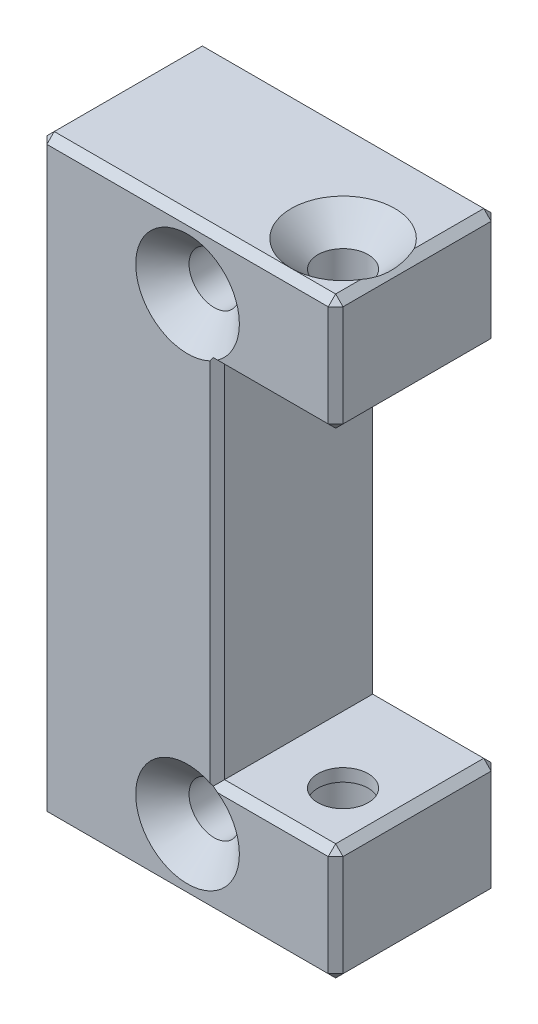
ISO-10303-21;
HEADER;
FILE_DESCRIPTION(('STEP AP214'),'2;1');
FILE_NAME('part.step','',(''),(''),'','','');
FILE_SCHEMA(('AUTOMOTIVE_DESIGN { 1 0 10303 214 1 1 1 1 }'));
ENDSEC;
DATA;
#1=APPLICATION_CONTEXT('core data for automotive mechanical design processes');
#2=APPLICATION_PROTOCOL_DEFINITION('international standard','automotive_design',2000,#1);
#3=PRODUCT_CONTEXT('',#1,'mechanical');
#4=PRODUCT('Part','Part','',(#3));
#5=PRODUCT_RELATED_PRODUCT_CATEGORY('part','',(#4));
#6=PRODUCT_DEFINITION_FORMATION('','',#4);
#7=PRODUCT_DEFINITION_CONTEXT('part definition',#1,'design');
#8=PRODUCT_DEFINITION('design','',#6,#7);
#9=PRODUCT_DEFINITION_SHAPE('','',#8);
#10=(LENGTH_UNIT() NAMED_UNIT(*) SI_UNIT(.MILLI.,.METRE.));
#11=(NAMED_UNIT(*) PLANE_ANGLE_UNIT() SI_UNIT($,.RADIAN.));
#12=(NAMED_UNIT(*) SI_UNIT($,.STERADIAN.) SOLID_ANGLE_UNIT());
#13=UNCERTAINTY_MEASURE_WITH_UNIT(LENGTH_MEASURE(1.E-05),#10,'distance_accuracy_value','');
#14=(GEOMETRIC_REPRESENTATION_CONTEXT(3) GLOBAL_UNCERTAINTY_ASSIGNED_CONTEXT((#13)) GLOBAL_UNIT_ASSIGNED_CONTEXT((#10,
#11,#12)) REPRESENTATION_CONTEXT('',''));
#15=CARTESIAN_POINT('',(0.,0.,0.));
#16=DIRECTION('',(0.,0.,1.));
#17=DIRECTION('',(1.,0.,0.));
#18=AXIS2_PLACEMENT_3D('',#15,#16,#17);
#19=CARTESIAN_POINT('',(6.5,20.,7.));
#20=DIRECTION('',(0.,1.,0.));
#21=DIRECTION('',(0.,0.,1.));
#22=AXIS2_PLACEMENT_3D('',#19,#20,#21);
#23=CYLINDRICAL_SURFACE('',#22,1.69999999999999);
#24=CARTESIAN_POINT('',(6.5,-12.15,7.));
#25=DIRECTION('',(0.,-1.,0.));
#26=DIRECTION('',(1.,0.,0.));
#27=AXIS2_PLACEMENT_3D('',#24,#25,#26);
#28=CIRCLE('',#27,1.69999999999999);
#29=CARTESIAN_POINT('',(8.2,-12.15,7.));
#30=VERTEX_POINT('',#29);
#31=EDGE_CURVE('E612',#30,#30,#28,.T.);
#32=ORIENTED_EDGE('',*,*,#31,.F.);
#33=EDGE_LOOP('',(#32));
#34=FACE_BOUND('',#33,.T.);
#35=CARTESIAN_POINT('',(6.5,-13.,7.));
#36=DIRECTION('',(0.,-1.,0.));
#37=DIRECTION('',(0.,0.,-1.));
#38=AXIS2_PLACEMENT_3D('',#35,#36,#37);
#39=CIRCLE('',#38,1.69999999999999);
#40=CARTESIAN_POINT('',(6.5,-13.,5.30000000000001));
#41=VERTEX_POINT('',#40);
#42=EDGE_CURVE('E45',#41,#41,#39,.F.);
#43=ORIENTED_EDGE('',*,*,#42,.F.);
#44=EDGE_LOOP('',(#43));
#45=FACE_BOUND('',#44,.T.);
#46=ADVANCED_FACE('F40',(#34,#45),#23,.F.);
#47=CARTESIAN_POINT('',(-10.,20.,11.));
#48=DIRECTION('',(0.,-1.,0.));
#49=DIRECTION('',(0.,0.,-1.));
#50=AXIS2_PLACEMENT_3D('',#47,#48,#49);
#51=PLANE('',#50);
#52=CARTESIAN_POINT('',(6.5,20.,7.));
#53=DIRECTION('',(0.,1.,0.));
#54=DIRECTION('',(0.,0.,1.));
#55=AXIS2_PLACEMENT_3D('',#52,#53,#54);
#56=CIRCLE('',#55,3.5);
#57=CARTESIAN_POINT('',(9.49999999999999,20.,5.19722436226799));
#58=VERTEX_POINT('',#57);
#59=CARTESIAN_POINT('',(6.5,20.,10.5));
#60=VERTEX_POINT('',#59);
#61=EDGE_CURVE('E215',#58,#60,#56,.T.);
#62=ORIENTED_EDGE('',*,*,#61,.F.);
#63=DIRECTION('',(0.,0.,-1.));
#64=VECTOR('',#63,1.);
#65=CARTESIAN_POINT('',(9.49999999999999,20.,11.));
#66=LINE('',#65,#64);
#67=CARTESIAN_POINT('',(9.49999999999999,20.,0.500000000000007));
#68=VERTEX_POINT('',#67);
#69=EDGE_CURVE('E229',#58,#68,#66,.T.);
#70=ORIENTED_EDGE('',*,*,#69,.T.);
#71=DIRECTION('',(-1.,0.,0.));
#72=VECTOR('',#71,1.);
#73=CARTESIAN_POINT('',(-10.,20.,0.500000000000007));
#74=LINE('',#73,#72);
#75=CARTESIAN_POINT('',(-9.49999999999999,20.,0.500000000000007));
#76=VERTEX_POINT('',#75);
#77=EDGE_CURVE('E242',#68,#76,#74,.T.);
#78=ORIENTED_EDGE('',*,*,#77,.T.);
#79=DIRECTION('',(0.,0.,1.));
#80=VECTOR('',#79,1.);
#81=CARTESIAN_POINT('',(-9.49999999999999,20.,11.));
#82=LINE('',#81,#80);
#83=CARTESIAN_POINT('',(-9.49999999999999,20.,10.5));
#84=VERTEX_POINT('',#83);
#85=EDGE_CURVE('E249',#76,#84,#82,.T.);
#86=ORIENTED_EDGE('',*,*,#85,.T.);
#87=DIRECTION('',(1.,0.,0.));
#88=VECTOR('',#87,1.);
#89=CARTESIAN_POINT('',(-10.,20.,10.5));
#90=LINE('',#89,#88);
#91=EDGE_CURVE('E231',#84,#60,#90,.T.);
#92=ORIENTED_EDGE('',*,*,#91,.T.);
#93=EDGE_LOOP('',(#62,#70,#78,#86,#92));
#94=FACE_BOUND('',#93,.T.);
#95=ADVANCED_FACE('F228',(#94),#51,.F.);
#96=CARTESIAN_POINT('',(10.,-20.,11.));
#97=DIRECTION('',(-1.,0.,0.));
#98=DIRECTION('',(0.,0.,1.));
#99=AXIS2_PLACEMENT_3D('',#96,#97,#98);
#100=PLANE('',#99);
#101=DIRECTION('',(0.,-1.,0.));
#102=VECTOR('',#101,1.);
#103=CARTESIAN_POINT('',(10.,-20.,10.5));
#104=LINE('',#103,#102);
#105=CARTESIAN_POINT('',(10.,-12.65,10.5));
#106=VERTEX_POINT('',#105);
#107=CARTESIAN_POINT('',(10.,-19.5,10.5));
#108=VERTEX_POINT('',#107);
#109=EDGE_CURVE('E51',#106,#108,#104,.T.);
#110=ORIENTED_EDGE('',*,*,#109,.T.);
#111=DIRECTION('',(0.,0.,-1.));
#112=VECTOR('',#111,1.);
#113=CARTESIAN_POINT('',(10.,-19.5,11.));
#114=LINE('',#113,#112);
#115=CARTESIAN_POINT('',(10.,-19.5,0.500000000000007));
#116=VERTEX_POINT('',#115);
#117=EDGE_CURVE('E11',#108,#116,#114,.T.);
#118=ORIENTED_EDGE('',*,*,#117,.T.);
#119=DIRECTION('',(0.,1.,0.));
#120=VECTOR('',#119,1.);
#121=CARTESIAN_POINT('',(10.,-12.15,0.500000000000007));
#122=LINE('',#121,#120);
#123=CARTESIAN_POINT('',(10.,-12.65,0.500000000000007));
#124=VERTEX_POINT('',#123);
#125=EDGE_CURVE('E836',#116,#124,#122,.T.);
#126=ORIENTED_EDGE('',*,*,#125,.T.);
#127=DIRECTION('',(0.,0.,1.));
#128=VECTOR('',#127,1.);
#129=CARTESIAN_POINT('',(10.,-12.65,11.));
#130=LINE('',#129,#128);
#131=EDGE_CURVE('E62',#124,#106,#130,.T.);
#132=ORIENTED_EDGE('',*,*,#131,.T.);
#133=EDGE_LOOP('',(#110,#118,#126,#132));
#134=FACE_BOUND('',#133,.T.);
#135=ADVANCED_FACE('F422',(#134),#100,.F.);
#136=DIRECTION('',(0.,1.,0.));
#137=VECTOR('',#136,1.);
#138=CARTESIAN_POINT('',(10.,20.,0.500000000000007));
#139=LINE('',#138,#137);
#140=CARTESIAN_POINT('',(10.,12.65,0.500000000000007));
#141=VERTEX_POINT('',#140);
#142=CARTESIAN_POINT('',(10.,19.5,0.500000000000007));
#143=VERTEX_POINT('',#142);
#144=EDGE_CURVE('E224',#141,#143,#139,.T.);
#145=ORIENTED_EDGE('',*,*,#144,.T.);
#146=DIRECTION('',(0.,0.,1.));
#147=VECTOR('',#146,1.);
#148=CARTESIAN_POINT('',(10.,19.5,11.));
#149=LINE('',#148,#147);
#150=CARTESIAN_POINT('',(10.,19.5,10.5));
#151=VERTEX_POINT('',#150);
#152=EDGE_CURVE('E247',#143,#151,#149,.T.);
#153=ORIENTED_EDGE('',*,*,#152,.T.);
#154=DIRECTION('',(0.,-1.,0.));
#155=VECTOR('',#154,1.);
#156=CARTESIAN_POINT('',(10.,-20.,10.5));
#157=LINE('',#156,#155);
#158=CARTESIAN_POINT('',(10.,12.65,10.5));
#159=VERTEX_POINT('',#158);
#160=EDGE_CURVE('E241',#151,#159,#157,.T.);
#161=ORIENTED_EDGE('',*,*,#160,.T.);
#162=DIRECTION('',(0.,0.,-1.));
#163=VECTOR('',#162,1.);
#164=CARTESIAN_POINT('',(10.,12.65,11.));
#165=LINE('',#164,#163);
#166=EDGE_CURVE('E255',#159,#141,#165,.T.);
#167=ORIENTED_EDGE('',*,*,#166,.T.);
#168=EDGE_LOOP('',(#145,#153,#161,#167));
#169=FACE_BOUND('',#168,.T.);
#170=ADVANCED_FACE('F419',(#169),#100,.F.);
#171=CARTESIAN_POINT('',(9.49999999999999,20.,8.80277563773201));
#172=VERTEX_POINT('',#171);
#173=EDGE_CURVE('E218',#60,#172,#56,.T.);
#174=ORIENTED_EDGE('',*,*,#173,.F.);
#175=DIRECTION('',(1.,0.,0.));
#176=VECTOR('',#175,1.);
#177=CARTESIAN_POINT('',(-10.,20.,10.5));
#178=LINE('',#177,#176);
#179=CARTESIAN_POINT('',(9.49999999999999,20.,10.5));
#180=VERTEX_POINT('',#179);
#181=EDGE_CURVE('E651',#60,#180,#178,.T.);
#182=ORIENTED_EDGE('',*,*,#181,.T.);
#183=DIRECTION('',(0.,0.,-1.));
#184=VECTOR('',#183,1.);
#185=CARTESIAN_POINT('',(9.49999999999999,20.,11.));
#186=LINE('',#185,#184);
#187=EDGE_CURVE('E645',#180,#172,#186,.T.);
#188=ORIENTED_EDGE('',*,*,#187,.T.);
#189=EDGE_LOOP('',(#174,#182,#188));
#190=FACE_BOUND('',#189,.T.);
#191=ADVANCED_FACE('F415',(#190),#51,.F.);
#192=CARTESIAN_POINT('',(-10.,-20.,11.));
#193=DIRECTION('',(1.,0.,0.));
#194=DIRECTION('',(0.,0.,-1.));
#195=AXIS2_PLACEMENT_3D('',#192,#193,#194);
#196=PLANE('',#195);
#197=DIRECTION('',(0.,1.,0.));
#198=VECTOR('',#197,1.);
#199=CARTESIAN_POINT('',(-10.,-20.,10.5));
#200=LINE('',#199,#198);
#201=CARTESIAN_POINT('',(-10.,-19.5,10.5));
#202=VERTEX_POINT('',#201);
#203=CARTESIAN_POINT('',(-10.,19.5,10.5));
#204=VERTEX_POINT('',#203);
#205=EDGE_CURVE('E801',#202,#204,#200,.T.);
#206=ORIENTED_EDGE('',*,*,#205,.T.);
#207=DIRECTION('',(0.,0.,-1.));
#208=VECTOR('',#207,1.);
#209=CARTESIAN_POINT('',(-10.,19.5,11.));
#210=LINE('',#209,#208);
#211=CARTESIAN_POINT('',(-10.,19.5,0.500000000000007));
#212=VERTEX_POINT('',#211);
#213=EDGE_CURVE('E665',#204,#212,#210,.T.);
#214=ORIENTED_EDGE('',*,*,#213,.T.);
#215=DIRECTION('',(0.,-1.,0.));
#216=VECTOR('',#215,1.);
#217=CARTESIAN_POINT('',(-10.,-20.,0.500000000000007));
#218=LINE('',#217,#216);
#219=CARTESIAN_POINT('',(-10.,-19.5,0.500000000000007));
#220=VERTEX_POINT('',#219);
#221=EDGE_CURVE('E223',#212,#220,#218,.T.);
#222=ORIENTED_EDGE('',*,*,#221,.T.);
#223=DIRECTION('',(0.,0.,1.));
#224=VECTOR('',#223,1.);
#225=CARTESIAN_POINT('',(-10.,-19.5,11.));
#226=LINE('',#225,#224);
#227=EDGE_CURVE('E799',#220,#202,#226,.T.);
#228=ORIENTED_EDGE('',*,*,#227,.T.);
#229=EDGE_LOOP('',(#206,#214,#222,#228));
#230=FACE_BOUND('',#229,.T.);
#231=ADVANCED_FACE('F411',(#230),#196,.F.);
#232=CARTESIAN_POINT('',(-10.,-20.,11.));
#233=DIRECTION('',(0.,1.,0.));
#234=DIRECTION('',(0.,0.,1.));
#235=AXIS2_PLACEMENT_3D('',#232,#233,#234);
#236=PLANE('',#235);
#237=CARTESIAN_POINT('',(6.5,-20.,7.));
#238=DIRECTION('',(0.,-1.,0.));
#239=DIRECTION('',(0.,0.,-1.));
#240=AXIS2_PLACEMENT_3D('',#237,#238,#239);
#241=CIRCLE('',#240,2.);
#242=CARTESIAN_POINT('',(6.5,-20.,5.));
#243=VERTEX_POINT('',#242);
#244=EDGE_CURVE('E603',#243,#243,#241,.T.);
#245=ORIENTED_EDGE('',*,*,#244,.F.);
#246=EDGE_LOOP('',(#245));
#247=FACE_BOUND('',#246,.T.);
#248=DIRECTION('',(0.,0.,1.));
#249=VECTOR('',#248,1.);
#250=CARTESIAN_POINT('',(9.49999999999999,-20.,11.));
#251=LINE('',#250,#249);
#252=CARTESIAN_POINT('',(9.49999999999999,-20.,0.500000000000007));
#253=VERTEX_POINT('',#252);
#254=CARTESIAN_POINT('',(9.49999999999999,-20.,10.5));
#255=VERTEX_POINT('',#254);
#256=EDGE_CURVE('E774',#253,#255,#251,.T.);
#257=ORIENTED_EDGE('',*,*,#256,.T.);
#258=DIRECTION('',(-1.,0.,0.));
#259=VECTOR('',#258,1.);
#260=CARTESIAN_POINT('',(-10.,-20.,10.5));
#261=LINE('',#260,#259);
#262=CARTESIAN_POINT('',(-9.49999999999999,-20.,10.5));
#263=VERTEX_POINT('',#262);
#264=EDGE_CURVE('E781',#255,#263,#261,.T.);
#265=ORIENTED_EDGE('',*,*,#264,.T.);
#266=DIRECTION('',(0.,0.,-1.));
#267=VECTOR('',#266,1.);
#268=CARTESIAN_POINT('',(-9.49999999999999,-20.,11.));
#269=LINE('',#268,#267);
#270=CARTESIAN_POINT('',(-9.49999999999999,-20.,0.500000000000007));
#271=VERTEX_POINT('',#270);
#272=EDGE_CURVE('E777',#263,#271,#269,.T.);
#273=ORIENTED_EDGE('',*,*,#272,.T.);
#274=DIRECTION('',(1.,0.,0.));
#275=VECTOR('',#274,1.);
#276=CARTESIAN_POINT('',(10.,-20.,0.500000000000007));
#277=LINE('',#276,#275);
#278=EDGE_CURVE('E771',#271,#253,#277,.T.);
#279=ORIENTED_EDGE('',*,*,#278,.T.);
#280=EDGE_LOOP('',(#257,#265,#273,#279));
#281=FACE_BOUND('',#280,.T.);
#282=ADVANCED_FACE('F404',(#247,#281),#236,.F.);
#283=CARTESIAN_POINT('',(0.,0.,11.));
#284=DIRECTION('',(0.,0.,-1.));
#285=DIRECTION('',(-1.,0.,0.));
#286=AXIS2_PLACEMENT_3D('',#283,#284,#285);
#287=PLANE('',#286);
#288=CARTESIAN_POINT('',(0.,-15.5,11.));
#289=DIRECTION('',(0.,0.,1.));
#290=DIRECTION('',(1.,0.,0.));
#291=AXIS2_PLACEMENT_3D('',#288,#289,#290);
#292=CIRCLE('',#291,3.5);
#293=CARTESIAN_POINT('',(1.5,-12.3377223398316,11.));
#294=VERTEX_POINT('',#293);
#295=CARTESIAN_POINT('',(2.03162496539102,-12.65,11.));
#296=VERTEX_POINT('',#295);
#297=EDGE_CURVE('E628',#294,#296,#292,.T.);
#298=ORIENTED_EDGE('',*,*,#297,.F.);
#299=DIRECTION('',(0.,1.,0.));
#300=VECTOR('',#299,1.);
#301=CARTESIAN_POINT('',(1.5,0.,11.));
#302=LINE('',#301,#300);
#303=CARTESIAN_POINT('',(1.5,12.3377223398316,11.));
#304=VERTEX_POINT('',#303);
#305=EDGE_CURVE('E768',#294,#304,#302,.T.);
#306=ORIENTED_EDGE('',*,*,#305,.T.);
#307=CARTESIAN_POINT('',(0.,15.5,11.));
#308=DIRECTION('',(0.,0.,1.));
#309=DIRECTION('',(1.,0.,0.));
#310=AXIS2_PLACEMENT_3D('',#307,#308,#309);
#311=CIRCLE('',#310,3.5);
#312=CARTESIAN_POINT('',(2.03162496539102,12.65,11.));
#313=VERTEX_POINT('',#312);
#314=EDGE_CURVE('E616',#313,#304,#311,.T.);
#315=ORIENTED_EDGE('',*,*,#314,.F.);
#316=DIRECTION('',(1.,0.,0.));
#317=VECTOR('',#316,1.);
#318=CARTESIAN_POINT('',(0.,12.65,11.));
#319=LINE('',#318,#317);
#320=CARTESIAN_POINT('',(9.49999999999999,12.65,11.));
#321=VERTEX_POINT('',#320);
#322=EDGE_CURVE('E746',#313,#321,#319,.T.);
#323=ORIENTED_EDGE('',*,*,#322,.T.);
#324=DIRECTION('',(0.,1.,0.));
#325=VECTOR('',#324,1.);
#326=CARTESIAN_POINT('',(9.49999999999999,0.,11.));
#327=LINE('',#326,#325);
#328=CARTESIAN_POINT('',(9.49999999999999,19.5,11.));
#329=VERTEX_POINT('',#328);
#330=EDGE_CURVE('E681',#321,#329,#327,.T.);
#331=ORIENTED_EDGE('',*,*,#330,.T.);
#332=DIRECTION('',(-1.,0.,0.));
#333=VECTOR('',#332,1.);
#334=CARTESIAN_POINT('',(0.,19.5,11.));
#335=LINE('',#334,#333);
#336=CARTESIAN_POINT('',(-9.49999999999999,19.5,11.));
#337=VERTEX_POINT('',#336);
#338=EDGE_CURVE('E749',#329,#337,#335,.T.);
#339=ORIENTED_EDGE('',*,*,#338,.T.);
#340=DIRECTION('',(0.,-1.,0.));
#341=VECTOR('',#340,1.);
#342=CARTESIAN_POINT('',(-9.49999999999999,0.,11.));
#343=LINE('',#342,#341);
#344=CARTESIAN_POINT('',(-9.49999999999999,-19.5,11.));
#345=VERTEX_POINT('',#344);
#346=EDGE_CURVE('E748',#337,#345,#343,.T.);
#347=ORIENTED_EDGE('',*,*,#346,.T.);
#348=DIRECTION('',(1.,0.,0.));
#349=VECTOR('',#348,1.);
#350=CARTESIAN_POINT('',(0.,-19.5,11.));
#351=LINE('',#350,#349);
#352=CARTESIAN_POINT('',(9.49999999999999,-19.5,11.));
#353=VERTEX_POINT('',#352);
#354=EDGE_CURVE('E755',#345,#353,#351,.T.);
#355=ORIENTED_EDGE('',*,*,#354,.T.);
#356=DIRECTION('',(0.,1.,0.));
#357=VECTOR('',#356,1.);
#358=CARTESIAN_POINT('',(9.49999999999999,0.,11.));
#359=LINE('',#358,#357);
#360=CARTESIAN_POINT('',(9.49999999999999,-12.65,11.));
#361=VERTEX_POINT('',#360);
#362=EDGE_CURVE('E762',#353,#361,#359,.T.);
#363=ORIENTED_EDGE('',*,*,#362,.T.);
#364=DIRECTION('',(-1.,0.,0.));
#365=VECTOR('',#364,1.);
#366=CARTESIAN_POINT('',(0.,-12.65,11.));
#367=LINE('',#366,#365);
#368=EDGE_CURVE('E765',#361,#296,#367,.T.);
#369=ORIENTED_EDGE('',*,*,#368,.T.);
#370=EDGE_LOOP('',(#298,#306,#315,#323,#331,#339,#347,#355,#363,#369));
#371=FACE_BOUND('',#370,.T.);
#372=ADVANCED_FACE('F401',(#371),#287,.F.);
#373=CARTESIAN_POINT('',(0.,0.,0.));
#374=DIRECTION('',(0.,0.,-1.));
#375=DIRECTION('',(-1.,0.,0.));
#376=AXIS2_PLACEMENT_3D('',#373,#374,#375);
#377=PLANE('',#376);
#378=DIRECTION('',(-1.,0.,0.));
#379=VECTOR('',#378,1.);
#380=CARTESIAN_POINT('',(-10.,-19.5,0.));
#381=LINE('',#380,#379);
#382=CARTESIAN_POINT('',(9.49999999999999,-19.5,0.));
#383=VERTEX_POINT('',#382);
#384=CARTESIAN_POINT('',(-9.49999999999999,-19.5,0.));
#385=VERTEX_POINT('',#384);
#386=EDGE_CURVE('E716',#383,#385,#381,.T.);
#387=ORIENTED_EDGE('',*,*,#386,.T.);
#388=DIRECTION('',(0.,1.,0.));
#389=VECTOR('',#388,1.);
#390=CARTESIAN_POINT('',(-9.49999999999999,20.,0.));
#391=LINE('',#390,#389);
#392=CARTESIAN_POINT('',(-9.49999999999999,19.5,0.));
#393=VERTEX_POINT('',#392);
#394=EDGE_CURVE('E719',#385,#393,#391,.T.);
#395=ORIENTED_EDGE('',*,*,#394,.T.);
#396=DIRECTION('',(1.,0.,0.));
#397=VECTOR('',#396,1.);
#398=CARTESIAN_POINT('',(10.,19.5,0.));
#399=LINE('',#398,#397);
#400=CARTESIAN_POINT('',(9.49999999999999,19.5,0.));
#401=VERTEX_POINT('',#400);
#402=EDGE_CURVE('E701',#393,#401,#399,.T.);
#403=ORIENTED_EDGE('',*,*,#402,.T.);
#404=DIRECTION('',(0.,-1.,0.));
#405=VECTOR('',#404,1.);
#406=CARTESIAN_POINT('',(9.49999999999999,12.15,0.));
#407=LINE('',#406,#405);
#408=CARTESIAN_POINT('',(9.49999999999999,12.65,0.));
#409=VERTEX_POINT('',#408);
#410=EDGE_CURVE('E687',#401,#409,#407,.T.);
#411=ORIENTED_EDGE('',*,*,#410,.T.);
#412=DIRECTION('',(-1.,0.,0.));
#413=VECTOR('',#412,1.);
#414=CARTESIAN_POINT('',(2.00000000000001,12.65,0.));
#415=LINE('',#414,#413);
#416=CARTESIAN_POINT('',(1.5,12.65,0.));
#417=VERTEX_POINT('',#416);
#418=EDGE_CURVE('E696',#409,#417,#415,.T.);
#419=ORIENTED_EDGE('',*,*,#418,.T.);
#420=DIRECTION('',(0.,-1.,0.));
#421=VECTOR('',#420,1.);
#422=CARTESIAN_POINT('',(1.5,-12.15,0.));
#423=LINE('',#422,#421);
#424=CARTESIAN_POINT('',(1.5,-12.65,0.));
#425=VERTEX_POINT('',#424);
#426=EDGE_CURVE('E700',#417,#425,#423,.T.);
#427=ORIENTED_EDGE('',*,*,#426,.T.);
#428=DIRECTION('',(1.,0.,0.));
#429=VECTOR('',#428,1.);
#430=CARTESIAN_POINT('',(10.,-12.65,0.));
#431=LINE('',#430,#429);
#432=CARTESIAN_POINT('',(9.49999999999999,-12.65,0.));
#433=VERTEX_POINT('',#432);
#434=EDGE_CURVE('E706',#425,#433,#431,.T.);
#435=ORIENTED_EDGE('',*,*,#434,.T.);
#436=DIRECTION('',(0.,-1.,0.));
#437=VECTOR('',#436,1.);
#438=CARTESIAN_POINT('',(9.49999999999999,-20.,0.));
#439=LINE('',#438,#437);
#440=EDGE_CURVE('E713',#433,#383,#439,.T.);
#441=ORIENTED_EDGE('',*,*,#440,.T.);
#442=EDGE_LOOP('',(#387,#395,#403,#411,#419,#427,#435,#441));
#443=FACE_BOUND('',#442,.T.);
#444=CARTESIAN_POINT('',(0.,15.5,0.));
#445=DIRECTION('',(0.,0.,1.));
#446=DIRECTION('',(1.,0.,0.));
#447=AXIS2_PLACEMENT_3D('',#444,#445,#446);
#448=CIRCLE('',#447,1.7);
#449=CARTESIAN_POINT('',(1.7,15.5,0.));
#450=VERTEX_POINT('',#449);
#451=EDGE_CURVE('E624',#450,#450,#448,.T.);
#452=ORIENTED_EDGE('',*,*,#451,.T.);
#453=EDGE_LOOP('',(#452));
#454=FACE_BOUND('',#453,.T.);
#455=CARTESIAN_POINT('',(0.,-15.5,0.));
#456=DIRECTION('',(0.,0.,1.));
#457=DIRECTION('',(1.,0.,0.));
#458=AXIS2_PLACEMENT_3D('',#455,#456,#457);
#459=CIRCLE('',#458,1.7);
#460=CARTESIAN_POINT('',(1.7,-15.5,0.));
#461=VERTEX_POINT('',#460);
#462=EDGE_CURVE('E636',#461,#461,#459,.T.);
#463=ORIENTED_EDGE('',*,*,#462,.T.);
#464=EDGE_LOOP('',(#463));
#465=FACE_BOUND('',#464,.T.);
#466=ADVANCED_FACE('F393',(#443,#454,#465),#377,.T.);
#467=CARTESIAN_POINT('',(10.,-12.15,0.));
#468=DIRECTION('',(0.,-1.,0.));
#469=DIRECTION('',(1.,0.,0.));
#470=AXIS2_PLACEMENT_3D('',#467,#468,#469);
#471=PLANE('',#470);
#472=ORIENTED_EDGE('',*,*,#31,.T.);
#473=EDGE_LOOP('',(#472));
#474=FACE_BOUND('',#473,.T.);
#475=DIRECTION('',(0.,0.,1.));
#476=VECTOR('',#475,1.);
#477=CARTESIAN_POINT('',(2.00000000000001,-12.15,0.));
#478=LINE('',#477,#476);
#479=CARTESIAN_POINT('',(2.00000000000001,-12.15,0.500000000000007));
#480=VERTEX_POINT('',#479);
#481=CARTESIAN_POINT('',(2.00000000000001,-12.15,10.5));
#482=VERTEX_POINT('',#481);
#483=EDGE_CURVE('E641',#480,#482,#478,.T.);
#484=ORIENTED_EDGE('',*,*,#483,.T.);
#485=DIRECTION('',(1.,0.,0.));
#486=VECTOR('',#485,1.);
#487=CARTESIAN_POINT('',(10.,-12.15,10.5));
#488=LINE('',#487,#486);
#489=CARTESIAN_POINT('',(9.49999999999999,-12.15,10.5));
#490=VERTEX_POINT('',#489);
#491=EDGE_CURVE('E841',#482,#490,#488,.T.);
#492=ORIENTED_EDGE('',*,*,#491,.T.);
#493=DIRECTION('',(0.,0.,-1.));
#494=VECTOR('',#493,1.);
#495=CARTESIAN_POINT('',(9.49999999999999,-12.15,0.));
#496=LINE('',#495,#494);
#497=CARTESIAN_POINT('',(9.49999999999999,-12.15,0.500000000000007));
#498=VERTEX_POINT('',#497);
#499=EDGE_CURVE('E860',#490,#498,#496,.T.);
#500=ORIENTED_EDGE('',*,*,#499,.T.);
#501=DIRECTION('',(-1.,0.,0.));
#502=VECTOR('',#501,1.);
#503=CARTESIAN_POINT('',(2.00000000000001,-12.15,0.500000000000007));
#504=LINE('',#503,#502);
#505=EDGE_CURVE('E370',#498,#480,#504,.T.);
#506=ORIENTED_EDGE('',*,*,#505,.T.);
#507=EDGE_LOOP('',(#484,#492,#500,#506));
#508=FACE_BOUND('',#507,.T.);
#509=ADVANCED_FACE('F389',(#474,#508),#471,.F.);
#510=CARTESIAN_POINT('',(2.00000000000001,12.15,0.));
#511=DIRECTION('',(-1.,0.,0.));
#512=DIRECTION('',(0.,0.,1.));
#513=AXIS2_PLACEMENT_3D('',#510,#511,#512);
#514=PLANE('',#513);
#515=DIRECTION('',(0.,0.,1.));
#516=VECTOR('',#515,1.);
#517=CARTESIAN_POINT('',(2.00000000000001,12.15,0.));
#518=LINE('',#517,#516);
#519=CARTESIAN_POINT('',(2.00000000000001,12.15,0.500000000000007));
#520=VERTEX_POINT('',#519);
#521=CARTESIAN_POINT('',(2.00000000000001,12.15,10.5));
#522=VERTEX_POINT('',#521);
#523=EDGE_CURVE('E640',#520,#522,#518,.T.);
#524=ORIENTED_EDGE('',*,*,#523,.T.);
#525=DIRECTION('',(0.,-1.,0.));
#526=VECTOR('',#525,1.);
#527=CARTESIAN_POINT('',(2.00000000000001,12.15,10.5));
#528=LINE('',#527,#526);
#529=EDGE_CURVE('E743',#522,#482,#528,.T.);
#530=ORIENTED_EDGE('',*,*,#529,.T.);
#531=ORIENTED_EDGE('',*,*,#483,.F.);
#532=DIRECTION('',(0.,1.,0.));
#533=VECTOR('',#532,1.);
#534=CARTESIAN_POINT('',(2.00000000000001,12.15,0.500000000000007));
#535=LINE('',#534,#533);
#536=EDGE_CURVE('E308',#480,#520,#535,.T.);
#537=ORIENTED_EDGE('',*,*,#536,.T.);
#538=EDGE_LOOP('',(#524,#530,#531,#537));
#539=FACE_BOUND('',#538,.T.);
#540=ADVANCED_FACE('F392',(#539),#514,.F.);
#541=CARTESIAN_POINT('',(10.,12.15,0.));
#542=DIRECTION('',(0.,1.,0.));
#543=DIRECTION('',(-1.,0.,0.));
#544=AXIS2_PLACEMENT_3D('',#541,#542,#543);
#545=PLANE('',#544);
#546=CARTESIAN_POINT('',(6.5,12.15,7.));
#547=DIRECTION('',(0.,1.,0.));
#548=DIRECTION('',(-1.,0.,0.));
#549=AXIS2_PLACEMENT_3D('',#546,#547,#548);
#550=CIRCLE('',#549,1.69999999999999);
#551=CARTESIAN_POINT('',(4.80000000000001,12.15,7.));
#552=VERTEX_POINT('',#551);
#553=EDGE_CURVE('E608',#552,#552,#550,.T.);
#554=ORIENTED_EDGE('',*,*,#553,.T.);
#555=EDGE_LOOP('',(#554));
#556=FACE_BOUND('',#555,.T.);
#557=DIRECTION('',(0.,0.,1.));
#558=VECTOR('',#557,1.);
#559=CARTESIAN_POINT('',(9.49999999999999,12.15,0.));
#560=LINE('',#559,#558);
#561=CARTESIAN_POINT('',(9.49999999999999,12.15,0.500000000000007));
#562=VERTEX_POINT('',#561);
#563=CARTESIAN_POINT('',(9.49999999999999,12.15,10.5));
#564=VERTEX_POINT('',#563);
#565=EDGE_CURVE('E723',#562,#564,#560,.T.);
#566=ORIENTED_EDGE('',*,*,#565,.T.);
#567=DIRECTION('',(-1.,0.,0.));
#568=VECTOR('',#567,1.);
#569=CARTESIAN_POINT('',(10.,12.15,10.5));
#570=LINE('',#569,#568);
#571=EDGE_CURVE('E727',#564,#522,#570,.T.);
#572=ORIENTED_EDGE('',*,*,#571,.T.);
#573=ORIENTED_EDGE('',*,*,#523,.F.);
#574=DIRECTION('',(1.,0.,0.));
#575=VECTOR('',#574,1.);
#576=CARTESIAN_POINT('',(10.,12.15,0.500000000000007));
#577=LINE('',#576,#575);
#578=EDGE_CURVE('E695',#520,#562,#577,.T.);
#579=ORIENTED_EDGE('',*,*,#578,.T.);
#580=EDGE_LOOP('',(#566,#572,#573,#579));
#581=FACE_BOUND('',#580,.T.);
#582=ADVANCED_FACE('F387',(#556,#581),#545,.F.);
#583=CARTESIAN_POINT('',(0.,-15.5,11.));
#584=DIRECTION('',(0.,0.,1.));
#585=DIRECTION('',(1.,0.,0.));
#586=AXIS2_PLACEMENT_3D('',#583,#584,#585);
#587=CYLINDRICAL_SURFACE('',#586,1.69999999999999);
#588=ORIENTED_EDGE('',*,*,#462,.F.);
#589=EDGE_LOOP('',(#588));
#590=FACE_BOUND('',#589,.T.);
#591=CARTESIAN_POINT('',(0.,-15.5,9.19999999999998));
#592=DIRECTION('',(0.,0.,1.));
#593=DIRECTION('',(1.,0.,0.));
#594=AXIS2_PLACEMENT_3D('',#591,#592,#593);
#595=CIRCLE('',#594,1.69999999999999);
#596=CARTESIAN_POINT('',(1.69999999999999,-15.5,9.19999999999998));
#597=VERTEX_POINT('',#596);
#598=EDGE_CURVE('E632',#597,#597,#595,.T.);
#599=ORIENTED_EDGE('',*,*,#598,.T.);
#600=EDGE_LOOP('',(#599));
#601=FACE_BOUND('',#600,.T.);
#602=ADVANCED_FACE('F382',(#590,#601),#587,.F.);
#603=CARTESIAN_POINT('',(0.,-15.5,11.));
#604=DIRECTION('',(0.,0.,1.));
#605=DIRECTION('',(1.,0.,0.));
#606=AXIS2_PLACEMENT_3D('',#603,#604,#605);
#607=CONICAL_SURFACE('',#606,3.5,0.785398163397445);
#608=ORIENTED_EDGE('',*,*,#598,.F.);
#609=EDGE_LOOP('',(#608));
#610=FACE_BOUND('',#609,.T.);
#611=CARTESIAN_POINT('',(2.03162496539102,-12.65,11.));
#612=CARTESIAN_POINT('',(1.99776756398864,-12.6391675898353,10.9891675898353));
#613=CARTESIAN_POINT('',(1.96376597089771,-12.6285599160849,10.9785599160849));
#614=CARTESIAN_POINT('',(1.89549359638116,-12.6078134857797,10.9578134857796));
#615=CARTESIAN_POINT('',(1.86122292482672,-12.5976745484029,10.9476745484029));
#616=CARTESIAN_POINT('',(1.79240461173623,-12.5778764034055,10.9278764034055));
#617=CARTESIAN_POINT('',(1.75785696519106,-12.5682172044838,10.9182172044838));
#618=CARTESIAN_POINT('',(1.68847941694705,-12.5493904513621,10.8993904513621));
#619=CARTESIAN_POINT('',(1.65364941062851,-12.5402230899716,10.8902230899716));
#620=CARTESIAN_POINT('',(1.61868872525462,-12.5313112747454,10.8813112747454));
#621=B_SPLINE_CURVE_WITH_KNOTS('',3,(#611,#612,#613,#614,#615,#616,#617,#618,#619,#620),
.UNSPECIFIED.,.F.,.F.,(4,2,2,2,4),(0.,0.11148453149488,0.222925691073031,0.33436887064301,
0.445855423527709),.UNSPECIFIED.);
#622=CARTESIAN_POINT('',(1.61868872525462,-12.5313112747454,10.8813112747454));
#623=VERTEX_POINT('',#622);
#624=EDGE_CURVE('E371',#296,#623,#621,.T.);
#625=ORIENTED_EDGE('',*,*,#624,.T.);
#626=CARTESIAN_POINT('',(1.61868872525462,-12.5313112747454,10.8813112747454));
#627=CARTESIAN_POINT('',(1.59926379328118,-12.4986092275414,10.9007362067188));
#628=CARTESIAN_POINT('',(1.57966058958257,-12.466125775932,10.9203394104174));
#629=CARTESIAN_POINT('',(1.54009768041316,-12.4015961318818,10.9599023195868));
#630=CARTESIAN_POINT('',(1.52013797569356,-12.36954993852,10.9798620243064));
#631=CARTESIAN_POINT('',(1.5,-12.3377223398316,11.));
#632=B_SPLINE_CURVE_WITH_KNOTS('',3,(#626,#627,#628,#629,#630,#631),.UNSPECIFIED.,.F.,.F.,(4,2,
4),(0.,0.128116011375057,0.256231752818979),.UNSPECIFIED.);
#633=EDGE_CURVE('E362',#623,#294,#632,.T.);
#634=ORIENTED_EDGE('',*,*,#633,.T.);
#635=ORIENTED_EDGE('',*,*,#297,.T.);
#636=EDGE_LOOP('',(#625,#634,#635));
#637=FACE_BOUND('',#636,.T.);
#638=ADVANCED_FACE('F378',(#610,#637),#607,.F.);
#639=CARTESIAN_POINT('',(0.,15.5,11.));
#640=DIRECTION('',(0.,0.,1.));
#641=DIRECTION('',(1.,0.,0.));
#642=AXIS2_PLACEMENT_3D('',#639,#640,#641);
#643=CYLINDRICAL_SURFACE('',#642,1.69999999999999);
#644=ORIENTED_EDGE('',*,*,#451,.F.);
#645=EDGE_LOOP('',(#644));
#646=FACE_BOUND('',#645,.T.);
#647=CARTESIAN_POINT('',(0.,15.5,9.19999999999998));
#648=DIRECTION('',(0.,0.,1.));
#649=DIRECTION('',(1.,0.,0.));
#650=AXIS2_PLACEMENT_3D('',#647,#648,#649);
#651=CIRCLE('',#650,1.69999999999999);
#652=CARTESIAN_POINT('',(1.69999999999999,15.5,9.19999999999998));
#653=VERTEX_POINT('',#652);
#654=EDGE_CURVE('E620',#653,#653,#651,.T.);
#655=ORIENTED_EDGE('',*,*,#654,.T.);
#656=EDGE_LOOP('',(#655));
#657=FACE_BOUND('',#656,.T.);
#658=ADVANCED_FACE('F287',(#646,#657),#643,.F.);
#659=CARTESIAN_POINT('',(0.,15.5,11.));
#660=DIRECTION('',(0.,0.,1.));
#661=DIRECTION('',(1.,0.,0.));
#662=AXIS2_PLACEMENT_3D('',#659,#660,#661);
#663=CONICAL_SURFACE('',#662,3.5,0.785398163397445);
#664=ORIENTED_EDGE('',*,*,#654,.F.);
#665=EDGE_LOOP('',(#664));
#666=FACE_BOUND('',#665,.T.);
#667=CARTESIAN_POINT('',(1.5,12.3377223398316,11.));
#668=CARTESIAN_POINT('',(1.52013797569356,12.36954993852,10.9798620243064));
#669=CARTESIAN_POINT('',(1.54009768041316,12.4015961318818,10.9599023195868));
#670=CARTESIAN_POINT('',(1.57966058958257,12.466125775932,10.9203394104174));
#671=CARTESIAN_POINT('',(1.59926379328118,12.4986092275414,10.9007362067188));
#672=CARTESIAN_POINT('',(1.61868872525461,12.5313112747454,10.8813112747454));
#673=B_SPLINE_CURVE_WITH_KNOTS('',3,(#667,#668,#669,#670,#671,#672),.UNSPECIFIED.,.F.,.F.,(4,2,
4),(0.,0.128115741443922,0.25623175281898),.UNSPECIFIED.);
#674=CARTESIAN_POINT('',(1.61868872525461,12.5313112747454,10.8813112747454));
#675=VERTEX_POINT('',#674);
#676=EDGE_CURVE('E292',#304,#675,#673,.T.);
#677=ORIENTED_EDGE('',*,*,#676,.T.);
#678=CARTESIAN_POINT('',(1.61868872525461,12.5313112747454,10.8813112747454));
#679=CARTESIAN_POINT('',(1.65364941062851,12.5402230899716,10.8902230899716));
#680=CARTESIAN_POINT('',(1.68847941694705,12.5493904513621,10.8993904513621));
#681=CARTESIAN_POINT('',(1.75785696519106,12.5682172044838,10.9182172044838));
#682=CARTESIAN_POINT('',(1.79240461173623,12.5778764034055,10.9278764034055));
#683=CARTESIAN_POINT('',(1.86122292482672,12.5976745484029,10.9476745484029));
#684=CARTESIAN_POINT('',(1.89549359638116,12.6078134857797,10.9578134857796));
#685=CARTESIAN_POINT('',(1.96376597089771,12.6285599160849,10.9785599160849));
#686=CARTESIAN_POINT('',(1.99776756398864,12.6391675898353,10.9891675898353));
#687=CARTESIAN_POINT('',(2.03162496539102,12.65,11.));
#688=B_SPLINE_CURVE_WITH_KNOTS('',3,(#678,#679,#680,#681,#682,#683,#684,#685,#686,#687),
.UNSPECIFIED.,.F.,.F.,(4,2,2,2,4),(0.,0.111486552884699,0.222929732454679,0.33437089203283,
0.445855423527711),.UNSPECIFIED.);
#689=EDGE_CURVE('E300',#675,#313,#688,.T.);
#690=ORIENTED_EDGE('',*,*,#689,.T.);
#691=ORIENTED_EDGE('',*,*,#314,.T.);
#692=EDGE_LOOP('',(#677,#690,#691));
#693=FACE_BOUND('',#692,.T.);
#694=ADVANCED_FACE('F283',(#666,#693),#663,.F.);
#695=CARTESIAN_POINT('',(6.5,18.2,7.));
#696=DIRECTION('',(0.,1.,0.));
#697=DIRECTION('',(0.,0.,1.));
#698=AXIS2_PLACEMENT_3D('',#695,#696,#697);
#699=CIRCLE('',#698,1.69999999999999);
#700=CARTESIAN_POINT('',(6.5,18.2,8.69999999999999));
#701=VERTEX_POINT('',#700);
#702=EDGE_CURVE('E233',#701,#701,#699,.T.);
#703=ORIENTED_EDGE('',*,*,#702,.T.);
#704=EDGE_LOOP('',(#703));
#705=FACE_BOUND('',#704,.T.);
#706=ORIENTED_EDGE('',*,*,#553,.F.);
#707=EDGE_LOOP('',(#706));
#708=FACE_BOUND('',#707,.T.);
#709=ADVANCED_FACE('F276',(#705,#708),#23,.F.);
#710=CARTESIAN_POINT('',(6.5,20.,7.));
#711=DIRECTION('',(0.,1.,0.));
#712=DIRECTION('',(0.,0.,1.));
#713=AXIS2_PLACEMENT_3D('',#710,#711,#712);
#714=CONICAL_SURFACE('',#713,3.5,0.785398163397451);
#715=ORIENTED_EDGE('',*,*,#702,.F.);
#716=EDGE_LOOP('',(#715));
#717=FACE_BOUND('',#716,.T.);
#718=CARTESIAN_POINT('',(9.49999999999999,20.,8.80277563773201));
#719=CARTESIAN_POINT('',(9.51990733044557,19.9800926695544,8.73099954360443));
#720=CARTESIAN_POINT('',(9.53878207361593,19.9612179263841,8.65865656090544));
#721=CARTESIAN_POINT('',(9.57434471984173,19.9256552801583,8.51288933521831));
#722=CARTESIAN_POINT('',(9.59103221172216,19.9089677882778,8.43946489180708));
#723=CARTESIAN_POINT('',(9.63764989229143,19.8623501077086,8.21754939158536));
#724=CARTESIAN_POINT('',(9.6640972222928,19.8359027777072,8.06755193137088));
#725=CARTESIAN_POINT('',(9.70669182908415,19.7933081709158,7.76533788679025));
#726=CARTESIAN_POINT('',(9.72288359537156,19.7771164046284,7.61313385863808));
#727=CARTESIAN_POINT('',(9.74453323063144,19.7554667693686,7.30728048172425));
#728=CARTESIAN_POINT('',(9.7499982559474,19.7500017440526,7.15363216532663));
#729=CARTESIAN_POINT('',(9.75000149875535,19.7499985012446,6.86797586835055));
#730=CARTESIAN_POINT('',(9.74596844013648,19.7540315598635,6.73596366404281));
#731=CARTESIAN_POINT('',(9.72995898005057,19.7700410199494,6.47290608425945));
#732=CARTESIAN_POINT('',(9.71798259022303,19.782017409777,6.3418607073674));
#733=CARTESIAN_POINT('',(9.68645101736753,19.8135489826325,6.08183785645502));
#734=CARTESIAN_POINT('',(9.66690777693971,19.8330922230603,5.95285745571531));
#735=CARTESIAN_POINT('',(9.62075444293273,19.8792455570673,5.69750804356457));
#736=CARTESIAN_POINT('',(9.59414732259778,19.9058526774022,5.57113795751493));
#737=CARTESIAN_POINT('',(9.55430477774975,19.9456952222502,5.40444450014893));
#738=CARTESIAN_POINT('',(9.54392596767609,19.9560740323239,5.36271873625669));
#739=CARTESIAN_POINT('',(9.52247727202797,19.977522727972,5.27967560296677));
#740=CARTESIAN_POINT('',(9.51140815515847,19.9885918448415,5.23835783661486));
#741=CARTESIAN_POINT('',(9.49999999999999,20.,5.19722436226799));
#742=B_SPLINE_CURVE_WITH_KNOTS('',3,(#718,#719,#720,#721,#722,#723,#724,#725,#726,#727,#728,
#729,#730,#731,#732,#733,#734,#735,#736,#737,#738,#739,#740,#741),.UNSPECIFIED.,.F.,.F.,(4,2,2,
2,2,2,2,2,2,2,2,4),(0.,0.231269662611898,0.462582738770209,0.925645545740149,1.38668553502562,
1.84741783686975,2.24334913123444,2.63927984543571,3.03458820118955,3.42973043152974,
3.56241822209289,3.69496080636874),.UNSPECIFIED.);
#743=EDGE_CURVE('E212',#172,#58,#742,.T.);
#744=ORIENTED_EDGE('',*,*,#743,.T.);
#745=ORIENTED_EDGE('',*,*,#61,.T.);
#746=ORIENTED_EDGE('',*,*,#173,.T.);
#747=EDGE_LOOP('',(#744,#745,#746));
#748=FACE_BOUND('',#747,.T.);
#749=ADVANCED_FACE('F214',(#717,#748),#714,.F.);
#750=CARTESIAN_POINT('',(9.49999999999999,0.,11.));
#751=DIRECTION('',(-0.707106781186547,0.,-0.707106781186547));
#752=DIRECTION('',(0.,1.,0.));
#753=AXIS2_PLACEMENT_3D('',#750,#751,#752);
#754=PLANE('',#753);
#755=DIRECTION('',(-0.707106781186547,0.,0.707106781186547));
#756=VECTOR('',#755,1.);
#757=CARTESIAN_POINT('',(9.75,-12.65,10.75));
#758=LINE('',#757,#756);
#759=EDGE_CURVE('E591',#361,#106,#758,.F.);
#760=ORIENTED_EDGE('',*,*,#759,.F.);
#761=ORIENTED_EDGE('',*,*,#362,.F.);
#762=DIRECTION('',(0.707106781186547,0.,-0.707106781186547));
#763=VECTOR('',#762,1.);
#764=CARTESIAN_POINT('',(9.75,-19.5,10.75));
#765=LINE('',#764,#763);
#766=EDGE_CURVE('E588',#108,#353,#765,.F.);
#767=ORIENTED_EDGE('',*,*,#766,.F.);
#768=ORIENTED_EDGE('',*,*,#109,.F.);
#769=EDGE_LOOP('',(#760,#761,#767,#768));
#770=FACE_BOUND('',#769,.T.);
#771=ADVANCED_FACE('F43',(#770),#754,.F.);
#772=CARTESIAN_POINT('',(9.49999999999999,-12.15,10.5));
#773=DIRECTION('',(0.577350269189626,0.577350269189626,0.577350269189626));
#774=DIRECTION('',(0.707106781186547,0.,-0.707106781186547));
#775=AXIS2_PLACEMENT_3D('',#772,#773,#774);
#776=PLANE('',#775);
#777=DIRECTION('',(0.,0.707106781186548,-0.707106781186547));
#778=VECTOR('',#777,1.);
#779=CARTESIAN_POINT('',(9.49999999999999,-12.15,10.5));
#780=LINE('',#779,#778);
#781=EDGE_CURVE('E576',#361,#490,#780,.T.);
#782=ORIENTED_EDGE('',*,*,#781,.F.);
#783=ORIENTED_EDGE('',*,*,#759,.T.);
#784=DIRECTION('',(0.707106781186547,-0.707106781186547,0.));
#785=VECTOR('',#784,1.);
#786=CARTESIAN_POINT('',(9.49999999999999,-12.15,10.5));
#787=LINE('',#786,#785);
#788=EDGE_CURVE('E580',#490,#106,#787,.T.);
#789=ORIENTED_EDGE('',*,*,#788,.F.);
#790=EDGE_LOOP('',(#782,#783,#789));
#791=FACE_BOUND('',#790,.T.);
#792=ADVANCED_FACE('F879',(#791),#776,.T.);
#793=CARTESIAN_POINT('',(9.49999999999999,-20.,10.5));
#794=DIRECTION('',(0.577350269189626,-0.577350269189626,0.577350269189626));
#795=DIRECTION('',(0.707106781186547,0.,-0.707106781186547));
#796=AXIS2_PLACEMENT_3D('',#793,#794,#795);
#797=PLANE('',#796);
#798=DIRECTION('',(0.,0.707106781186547,0.707106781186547));
#799=VECTOR('',#798,1.);
#800=CARTESIAN_POINT('',(9.49999999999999,-20.,10.5));
#801=LINE('',#800,#799);
#802=EDGE_CURVE('E572',#255,#353,#801,.T.);
#803=ORIENTED_EDGE('',*,*,#802,.F.);
#804=DIRECTION('',(-0.707106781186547,-0.707106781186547,0.));
#805=VECTOR('',#804,1.);
#806=CARTESIAN_POINT('',(9.49999999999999,-20.,10.5));
#807=LINE('',#806,#805);
#808=EDGE_CURVE('E584',#108,#255,#807,.T.);
#809=ORIENTED_EDGE('',*,*,#808,.F.);
#810=ORIENTED_EDGE('',*,*,#766,.T.);
#811=EDGE_LOOP('',(#803,#809,#810));
#812=FACE_BOUND('',#811,.T.);
#813=ADVANCED_FACE('F825',(#812),#797,.T.);
#814=CARTESIAN_POINT('',(10.,-19.5,11.));
#815=DIRECTION('',(-0.707106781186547,0.707106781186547,0.));
#816=DIRECTION('',(0.,0.,-1.));
#817=AXIS2_PLACEMENT_3D('',#814,#815,#816);
#818=PLANE('',#817);
#819=ORIENTED_EDGE('',*,*,#808,.T.);
#820=ORIENTED_EDGE('',*,*,#256,.F.);
#821=DIRECTION('',(0.707106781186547,0.707106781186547,0.));
#822=VECTOR('',#821,1.);
#823=CARTESIAN_POINT('',(10.,-19.5,0.500000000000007));
#824=LINE('',#823,#822);
#825=EDGE_CURVE('E568',#116,#253,#824,.F.);
#826=ORIENTED_EDGE('',*,*,#825,.F.);
#827=ORIENTED_EDGE('',*,*,#117,.F.);
#828=EDGE_LOOP('',(#819,#820,#826,#827));
#829=FACE_BOUND('',#828,.T.);
#830=ADVANCED_FACE('F834',(#829),#818,.F.);
#831=CARTESIAN_POINT('',(10.,-20.,0.500000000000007));
#832=DIRECTION('',(0.707106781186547,0.,-0.707106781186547));
#833=DIRECTION('',(0.,-1.,0.));
#834=AXIS2_PLACEMENT_3D('',#831,#832,#833);
#835=PLANE('',#834);
#836=DIRECTION('',(-0.707106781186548,0.,-0.707106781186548));
#837=VECTOR('',#836,1.);
#838=CARTESIAN_POINT('',(9.75,-12.65,0.250000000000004));
#839=LINE('',#838,#837);
#840=EDGE_CURVE('E561',#124,#433,#839,.T.);
#841=ORIENTED_EDGE('',*,*,#840,.F.);
#842=ORIENTED_EDGE('',*,*,#125,.F.);
#843=DIRECTION('',(0.707106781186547,0.,0.707106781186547));
#844=VECTOR('',#843,1.);
#845=CARTESIAN_POINT('',(10.,-19.5,0.500000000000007));
#846=LINE('',#845,#844);
#847=EDGE_CURVE('E565',#383,#116,#846,.T.);
#848=ORIENTED_EDGE('',*,*,#847,.F.);
#849=ORIENTED_EDGE('',*,*,#440,.F.);
#850=EDGE_LOOP('',(#841,#842,#848,#849));
#851=FACE_BOUND('',#850,.T.);
#852=ADVANCED_FACE('F851',(#851),#835,.T.);
#853=CARTESIAN_POINT('',(10.,-12.65,11.));
#854=DIRECTION('',(-0.707106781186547,-0.707106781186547,0.));
#855=DIRECTION('',(0.,0.,1.));
#856=AXIS2_PLACEMENT_3D('',#853,#854,#855);
#857=PLANE('',#856);
#858=ORIENTED_EDGE('',*,*,#788,.T.);
#859=ORIENTED_EDGE('',*,*,#131,.F.);
#860=DIRECTION('',(-0.707106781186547,0.707106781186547,0.));
#861=VECTOR('',#860,1.);
#862=CARTESIAN_POINT('',(9.49999999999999,-12.15,0.500000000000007));
#863=LINE('',#862,#861);
#864=EDGE_CURVE('E557',#498,#124,#863,.F.);
#865=ORIENTED_EDGE('',*,*,#864,.F.);
#866=ORIENTED_EDGE('',*,*,#499,.F.);
#867=EDGE_LOOP('',(#858,#859,#865,#866));
#868=FACE_BOUND('',#867,.T.);
#869=ADVANCED_FACE('F845',(#868),#857,.F.);
#870=CARTESIAN_POINT('',(10.,-12.15,10.5));
#871=DIRECTION('',(0.,-0.707106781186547,-0.707106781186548));
#872=DIRECTION('',(1.,0.,0.));
#873=AXIS2_PLACEMENT_3D('',#870,#871,#872);
#874=PLANE('',#873);
#875=ORIENTED_EDGE('',*,*,#781,.T.);
#876=ORIENTED_EDGE('',*,*,#491,.F.);
#877=DIRECTION('',(0.577350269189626,0.577350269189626,-0.577350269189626));
#878=VECTOR('',#877,1.);
#879=CARTESIAN_POINT('',(4.66666666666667,-9.48333333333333,7.83333333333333));
#880=LINE('',#879,#878);
#881=EDGE_CURVE('E553',#623,#482,#880,.T.);
#882=ORIENTED_EDGE('',*,*,#881,.F.);
#883=ORIENTED_EDGE('',*,*,#624,.F.);
#884=ORIENTED_EDGE('',*,*,#368,.F.);
#885=EDGE_LOOP('',(#875,#876,#882,#883,#884));
#886=FACE_BOUND('',#885,.T.);
#887=ADVANCED_FACE('F877',(#886),#874,.F.);
#888=CARTESIAN_POINT('',(0.,-19.5,11.));
#889=DIRECTION('',(0.,0.707106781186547,-0.707106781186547));
#890=DIRECTION('',(1.,0.,0.));
#891=AXIS2_PLACEMENT_3D('',#888,#889,#890);
#892=PLANE('',#891);
#893=ORIENTED_EDGE('',*,*,#802,.T.);
#894=ORIENTED_EDGE('',*,*,#354,.F.);
#895=DIRECTION('',(0.,-0.707106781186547,-0.707106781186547));
#896=VECTOR('',#895,1.);
#897=CARTESIAN_POINT('',(-9.49999999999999,-19.5,11.));
#898=LINE('',#897,#896);
#899=EDGE_CURVE('E549',#263,#345,#898,.F.);
#900=ORIENTED_EDGE('',*,*,#899,.F.);
#901=ORIENTED_EDGE('',*,*,#264,.F.);
#902=EDGE_LOOP('',(#893,#894,#900,#901));
#903=FACE_BOUND('',#902,.T.);
#904=ADVANCED_FACE('F828',(#903),#892,.F.);
#905=CARTESIAN_POINT('',(10.,-19.5,0.500000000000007));
#906=DIRECTION('',(0.577350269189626,-0.577350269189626,-0.577350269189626));
#907=DIRECTION('',(-0.707106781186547,0.,-0.707106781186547));
#908=AXIS2_PLACEMENT_3D('',#905,#906,#907);
#909=PLANE('',#908);
#910=ORIENTED_EDGE('',*,*,#847,.T.);
#911=ORIENTED_EDGE('',*,*,#825,.T.);
#912=DIRECTION('',(0.,0.707106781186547,-0.707106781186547));
#913=VECTOR('',#912,1.);
#914=CARTESIAN_POINT('',(9.49999999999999,-19.75,0.250000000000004));
#915=LINE('',#914,#913);
#916=EDGE_CURVE('E541',#383,#253,#915,.F.);
#917=ORIENTED_EDGE('',*,*,#916,.F.);
#918=EDGE_LOOP('',(#910,#911,#917));
#919=FACE_BOUND('',#918,.T.);
#920=ADVANCED_FACE('F918',(#919),#909,.T.);
#921=CARTESIAN_POINT('',(9.49999999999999,-12.15,0.500000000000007));
#922=DIRECTION('',(0.577350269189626,0.577350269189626,-0.577350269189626));
#923=DIRECTION('',(0.,0.707106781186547,0.707106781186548));
#924=AXIS2_PLACEMENT_3D('',#921,#922,#923);
#925=PLANE('',#924);
#926=ORIENTED_EDGE('',*,*,#864,.T.);
#927=ORIENTED_EDGE('',*,*,#840,.T.);
#928=DIRECTION('',(0.,0.707106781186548,0.707106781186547));
#929=VECTOR('',#928,1.);
#930=CARTESIAN_POINT('',(9.49999999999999,-12.15,0.500000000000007));
#931=LINE('',#930,#929);
#932=EDGE_CURVE('E537',#498,#433,#931,.F.);
#933=ORIENTED_EDGE('',*,*,#932,.F.);
#934=EDGE_LOOP('',(#926,#927,#933));
#935=FACE_BOUND('',#934,.T.);
#936=ADVANCED_FACE('F357',(#935),#925,.T.);
#937=CARTESIAN_POINT('',(2.00000000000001,12.15,10.5));
#938=DIRECTION('',(-0.707106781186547,0.,-0.707106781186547));
#939=DIRECTION('',(0.,-1.,0.));
#940=AXIS2_PLACEMENT_3D('',#937,#938,#939);
#941=PLANE('',#940);
#942=ORIENTED_EDGE('',*,*,#881,.T.);
#943=ORIENTED_EDGE('',*,*,#529,.F.);
#944=DIRECTION('',(0.577350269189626,-0.577350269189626,-0.577350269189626));
#945=VECTOR('',#944,1.);
#946=CARTESIAN_POINT('',(2.00000000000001,12.15,10.5));
#947=LINE('',#946,#945);
#948=EDGE_CURVE('E534',#675,#522,#947,.T.);
#949=ORIENTED_EDGE('',*,*,#948,.F.);
#950=ORIENTED_EDGE('',*,*,#676,.F.);
#951=ORIENTED_EDGE('',*,*,#305,.F.);
#952=ORIENTED_EDGE('',*,*,#633,.F.);
#953=EDGE_LOOP('',(#942,#943,#949,#950,#951,#952));
#954=FACE_BOUND('',#953,.T.);
#955=ADVANCED_FACE('F349',(#954),#941,.F.);
#956=CARTESIAN_POINT('',(-9.49999999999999,-19.5,11.));
#957=DIRECTION('',(-0.577350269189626,-0.577350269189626,0.577350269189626));
#958=DIRECTION('',(0.707106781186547,0.,0.707106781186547));
#959=AXIS2_PLACEMENT_3D('',#956,#957,#958);
#960=PLANE('',#959);
#961=DIRECTION('',(0.707106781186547,0.,0.707106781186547));
#962=VECTOR('',#961,1.);
#963=CARTESIAN_POINT('',(-9.49999999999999,-19.5,11.));
#964=LINE('',#963,#962);
#965=EDGE_CURVE('E531',#202,#345,#964,.T.);
#966=ORIENTED_EDGE('',*,*,#965,.F.);
#967=DIRECTION('',(-0.707106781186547,0.707106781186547,0.));
#968=VECTOR('',#967,1.);
#969=CARTESIAN_POINT('',(-9.74999999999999,-19.75,10.5));
#970=LINE('',#969,#968);
#971=EDGE_CURVE('E545',#263,#202,#970,.T.);
#972=ORIENTED_EDGE('',*,*,#971,.F.);
#973=ORIENTED_EDGE('',*,*,#899,.T.);
#974=EDGE_LOOP('',(#966,#972,#973));
#975=FACE_BOUND('',#974,.T.);
#976=ADVANCED_FACE('F343',(#975),#960,.T.);
#977=CARTESIAN_POINT('',(-9.49999999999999,-20.,11.));
#978=DIRECTION('',(0.707106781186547,0.707106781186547,0.));
#979=DIRECTION('',(0.,0.,-1.));
#980=AXIS2_PLACEMENT_3D('',#977,#978,#979);
#981=PLANE('',#980);
#982=ORIENTED_EDGE('',*,*,#971,.T.);
#983=ORIENTED_EDGE('',*,*,#227,.F.);
#984=DIRECTION('',(0.707106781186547,-0.707106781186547,0.));
#985=VECTOR('',#984,1.);
#986=CARTESIAN_POINT('',(-9.49999999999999,-20.,0.500000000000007));
#987=LINE('',#986,#985);
#988=EDGE_CURVE('E527',#271,#220,#987,.F.);
#989=ORIENTED_EDGE('',*,*,#988,.F.);
#990=ORIENTED_EDGE('',*,*,#272,.F.);
#991=EDGE_LOOP('',(#982,#983,#989,#990));
#992=FACE_BOUND('',#991,.T.);
#993=ADVANCED_FACE('F336',(#992),#981,.F.);
#994=CARTESIAN_POINT('',(-10.,-20.,0.500000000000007));
#995=DIRECTION('',(0.,-0.707106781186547,-0.707106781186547));
#996=DIRECTION('',(-1.,0.,0.));
#997=AXIS2_PLACEMENT_3D('',#994,#995,#996);
#998=PLANE('',#997);
#999=ORIENTED_EDGE('',*,*,#916,.T.);
#1000=ORIENTED_EDGE('',*,*,#278,.F.);
#1001=DIRECTION('',(0.,-0.707106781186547,0.707106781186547));
#1002=VECTOR('',#1001,1.);
#1003=CARTESIAN_POINT('',(-9.49999999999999,-20.,0.500000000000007));
#1004=LINE('',#1003,#1002);
#1005=EDGE_CURVE('E524',#385,#271,#1004,.T.);
#1006=ORIENTED_EDGE('',*,*,#1005,.F.);
#1007=ORIENTED_EDGE('',*,*,#386,.F.);
#1008=EDGE_LOOP('',(#999,#1000,#1006,#1007));
#1009=FACE_BOUND('',#1008,.T.);
#1010=ADVANCED_FACE('F329',(#1009),#998,.T.);
#1011=CARTESIAN_POINT('',(0.,-12.65,0.));
#1012=DIRECTION('',(0.,0.707106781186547,-0.707106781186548));
#1013=DIRECTION('',(-1.,0.,0.));
#1014=AXIS2_PLACEMENT_3D('',#1011,#1012,#1013);
#1015=PLANE('',#1014);
#1016=ORIENTED_EDGE('',*,*,#932,.T.);
#1017=ORIENTED_EDGE('',*,*,#434,.F.);
#1018=DIRECTION('',(-0.577350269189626,-0.577350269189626,-0.577350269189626));
#1019=VECTOR('',#1018,1.);
#1020=CARTESIAN_POINT('',(0.999999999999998,-13.15,-0.5));
#1021=LINE('',#1020,#1019);
#1022=EDGE_CURVE('E520',#480,#425,#1021,.T.);
#1023=ORIENTED_EDGE('',*,*,#1022,.F.);
#1024=ORIENTED_EDGE('',*,*,#505,.F.);
#1025=EDGE_LOOP('',(#1016,#1017,#1023,#1024));
#1026=FACE_BOUND('',#1025,.T.);
#1027=ADVANCED_FACE('F321',(#1026),#1015,.T.);
#1028=CARTESIAN_POINT('',(10.,12.15,10.5));
#1029=DIRECTION('',(0.,0.707106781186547,-0.707106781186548));
#1030=DIRECTION('',(-1.,0.,0.));
#1031=AXIS2_PLACEMENT_3D('',#1028,#1029,#1030);
#1032=PLANE('',#1031);
#1033=ORIENTED_EDGE('',*,*,#948,.T.);
#1034=ORIENTED_EDGE('',*,*,#571,.F.);
#1035=DIRECTION('',(0.,0.707106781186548,0.707106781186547));
#1036=VECTOR('',#1035,1.);
#1037=CARTESIAN_POINT('',(9.49999999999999,12.65,11.));
#1038=LINE('',#1037,#1036);
#1039=EDGE_CURVE('E516',#321,#564,#1038,.F.);
#1040=ORIENTED_EDGE('',*,*,#1039,.F.);
#1041=ORIENTED_EDGE('',*,*,#322,.F.);
#1042=ORIENTED_EDGE('',*,*,#689,.F.);
#1043=EDGE_LOOP('',(#1033,#1034,#1040,#1041,#1042));
#1044=FACE_BOUND('',#1043,.T.);
#1045=ADVANCED_FACE('F311',(#1044),#1032,.F.);
#1046=CARTESIAN_POINT('',(-9.49999999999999,0.,11.));
#1047=DIRECTION('',(0.707106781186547,0.,-0.707106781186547));
#1048=DIRECTION('',(0.,-1.,0.));
#1049=AXIS2_PLACEMENT_3D('',#1046,#1047,#1048);
#1050=PLANE('',#1049);
#1051=ORIENTED_EDGE('',*,*,#965,.T.);
#1052=ORIENTED_EDGE('',*,*,#346,.F.);
#1053=DIRECTION('',(-0.707106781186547,0.,-0.707106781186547));
#1054=VECTOR('',#1053,1.);
#1055=CARTESIAN_POINT('',(-9.74999999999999,19.5,10.75));
#1056=LINE('',#1055,#1054);
#1057=EDGE_CURVE('E512',#204,#337,#1056,.F.);
#1058=ORIENTED_EDGE('',*,*,#1057,.F.);
#1059=ORIENTED_EDGE('',*,*,#205,.F.);
#1060=EDGE_LOOP('',(#1051,#1052,#1058,#1059));
#1061=FACE_BOUND('',#1060,.T.);
#1062=ADVANCED_FACE('F320',(#1061),#1050,.F.);
#1063=CARTESIAN_POINT('',(-9.49999999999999,-20.,0.500000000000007));
#1064=DIRECTION('',(-0.577350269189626,-0.577350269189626,-0.577350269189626));
#1065=DIRECTION('',(-0.707106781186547,0.,0.707106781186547));
#1066=AXIS2_PLACEMENT_3D('',#1063,#1064,#1065);
#1067=PLANE('',#1066);
#1068=ORIENTED_EDGE('',*,*,#1005,.T.);
#1069=ORIENTED_EDGE('',*,*,#988,.T.);
#1070=DIRECTION('',(0.707106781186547,0.,-0.707106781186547));
#1071=VECTOR('',#1070,1.);
#1072=CARTESIAN_POINT('',(-9.74999999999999,-19.5,0.250000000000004));
#1073=LINE('',#1072,#1071);
#1074=EDGE_CURVE('E504',#385,#220,#1073,.F.);
#1075=ORIENTED_EDGE('',*,*,#1074,.F.);
#1076=EDGE_LOOP('',(#1068,#1069,#1075));
#1077=FACE_BOUND('',#1076,.T.);
#1078=ADVANCED_FACE('F952',(#1077),#1067,.T.);
#1079=CARTESIAN_POINT('',(1.5,0.,0.));
#1080=DIRECTION('',(0.707106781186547,0.,-0.707106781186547));
#1081=DIRECTION('',(0.,1.,0.));
#1082=AXIS2_PLACEMENT_3D('',#1079,#1080,#1081);
#1083=PLANE('',#1082);
#1084=ORIENTED_EDGE('',*,*,#1022,.T.);
#1085=ORIENTED_EDGE('',*,*,#426,.F.);
#1086=DIRECTION('',(-0.577350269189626,0.577350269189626,-0.577350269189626));
#1087=VECTOR('',#1086,1.);
#1088=CARTESIAN_POINT('',(5.71666666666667,8.43333333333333,4.21666666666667));
#1089=LINE('',#1088,#1087);
#1090=EDGE_CURVE('E500',#520,#417,#1089,.T.);
#1091=ORIENTED_EDGE('',*,*,#1090,.F.);
#1092=ORIENTED_EDGE('',*,*,#536,.F.);
#1093=EDGE_LOOP('',(#1084,#1085,#1091,#1092));
#1094=FACE_BOUND('',#1093,.T.);
#1095=ADVANCED_FACE('F930',(#1094),#1083,.T.);
#1096=CARTESIAN_POINT('',(9.49999999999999,12.65,11.));
#1097=DIRECTION('',(0.577350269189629,-0.577350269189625,0.577350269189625));
#1098=DIRECTION('',(0.707106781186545,0.,-0.70710678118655));
#1099=AXIS2_PLACEMENT_3D('',#1096,#1097,#1098);
#1100=PLANE('',#1099);
#1101=DIRECTION('',(0.707106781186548,0.,-0.707106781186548));
#1102=VECTOR('',#1101,1.);
#1103=CARTESIAN_POINT('',(9.49999999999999,12.65,11.));
#1104=LINE('',#1103,#1102);
#1105=EDGE_CURVE('E492',#321,#159,#1104,.T.);
#1106=ORIENTED_EDGE('',*,*,#1105,.F.);
#1107=ORIENTED_EDGE('',*,*,#1039,.T.);
#1108=DIRECTION('',(-0.707106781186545,-0.70710678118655,0.));
#1109=VECTOR('',#1108,1.);
#1110=CARTESIAN_POINT('',(9.75,12.4,10.5));
#1111=LINE('',#1110,#1109);
#1112=EDGE_CURVE('E496',#159,#564,#1111,.T.);
#1113=ORIENTED_EDGE('',*,*,#1112,.F.);
#1114=EDGE_LOOP('',(#1106,#1107,#1113));
#1115=FACE_BOUND('',#1114,.T.);
#1116=ADVANCED_FACE('F944',(#1115),#1100,.T.);
#1117=CARTESIAN_POINT('',(-9.49999999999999,20.,10.5));
#1118=DIRECTION('',(-0.577350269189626,0.577350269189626,0.577350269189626));
#1119=DIRECTION('',(0.707106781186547,0.,0.707106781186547));
#1120=AXIS2_PLACEMENT_3D('',#1117,#1118,#1119);
#1121=PLANE('',#1120);
#1122=DIRECTION('',(0.,-0.707106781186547,0.707106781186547));
#1123=VECTOR('',#1122,1.);
#1124=CARTESIAN_POINT('',(-9.49999999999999,20.,10.5));
#1125=LINE('',#1124,#1123);
#1126=EDGE_CURVE('E488',#84,#337,#1125,.T.);
#1127=ORIENTED_EDGE('',*,*,#1126,.F.);
#1128=DIRECTION('',(0.707106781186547,0.707106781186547,0.));
#1129=VECTOR('',#1128,1.);
#1130=CARTESIAN_POINT('',(-9.49999999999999,20.,10.5));
#1131=LINE('',#1130,#1129);
#1132=EDGE_CURVE('E508',#204,#84,#1131,.T.);
#1133=ORIENTED_EDGE('',*,*,#1132,.F.);
#1134=ORIENTED_EDGE('',*,*,#1057,.T.);
#1135=EDGE_LOOP('',(#1127,#1133,#1134));
#1136=FACE_BOUND('',#1135,.T.);
#1137=ADVANCED_FACE('F667',(#1136),#1121,.T.);
#1138=CARTESIAN_POINT('',(-10.,19.5,11.));
#1139=DIRECTION('',(0.707106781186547,-0.707106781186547,0.));
#1140=DIRECTION('',(0.,0.,-1.));
#1141=AXIS2_PLACEMENT_3D('',#1138,#1139,#1140);
#1142=PLANE('',#1141);
#1143=ORIENTED_EDGE('',*,*,#1132,.T.);
#1144=ORIENTED_EDGE('',*,*,#85,.F.);
#1145=DIRECTION('',(-0.707106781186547,-0.707106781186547,0.));
#1146=VECTOR('',#1145,1.);
#1147=CARTESIAN_POINT('',(-10.,19.5,0.500000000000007));
#1148=LINE('',#1147,#1146);
#1149=EDGE_CURVE('E484',#212,#76,#1148,.F.);
#1150=ORIENTED_EDGE('',*,*,#1149,.F.);
#1151=ORIENTED_EDGE('',*,*,#213,.F.);
#1152=EDGE_LOOP('',(#1143,#1144,#1150,#1151));
#1153=FACE_BOUND('',#1152,.T.);
#1154=ADVANCED_FACE('F663',(#1153),#1142,.F.);
#1155=CARTESIAN_POINT('',(-10.,-20.,0.500000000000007));
#1156=DIRECTION('',(-0.707106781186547,0.,-0.707106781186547));
#1157=DIRECTION('',(0.,1.,0.));
#1158=AXIS2_PLACEMENT_3D('',#1155,#1156,#1157);
#1159=PLANE('',#1158);
#1160=ORIENTED_EDGE('',*,*,#1074,.T.);
#1161=ORIENTED_EDGE('',*,*,#221,.F.);
#1162=DIRECTION('',(-0.707106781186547,0.,0.707106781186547));
#1163=VECTOR('',#1162,1.);
#1164=CARTESIAN_POINT('',(-10.,19.5,0.500000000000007));
#1165=LINE('',#1164,#1163);
#1166=EDGE_CURVE('E481',#393,#212,#1165,.T.);
#1167=ORIENTED_EDGE('',*,*,#1166,.F.);
#1168=ORIENTED_EDGE('',*,*,#394,.F.);
#1169=EDGE_LOOP('',(#1160,#1161,#1167,#1168));
#1170=FACE_BOUND('',#1169,.T.);
#1171=ADVANCED_FACE('F795',(#1170),#1159,.T.);
#1172=CARTESIAN_POINT('',(0.,12.65,0.));
#1173=DIRECTION('',(0.,-0.707106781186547,-0.707106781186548));
#1174=DIRECTION('',(1.,0.,0.));
#1175=AXIS2_PLACEMENT_3D('',#1172,#1173,#1174);
#1176=PLANE('',#1175);
#1177=ORIENTED_EDGE('',*,*,#1090,.T.);
#1178=ORIENTED_EDGE('',*,*,#418,.F.);
#1179=DIRECTION('',(0.,0.707106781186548,-0.707106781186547));
#1180=VECTOR('',#1179,1.);
#1181=CARTESIAN_POINT('',(9.49999999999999,12.15,0.500000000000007));
#1182=LINE('',#1181,#1180);
#1183=EDGE_CURVE('E477',#562,#409,#1182,.T.);
#1184=ORIENTED_EDGE('',*,*,#1183,.F.);
#1185=ORIENTED_EDGE('',*,*,#578,.F.);
#1186=EDGE_LOOP('',(#1177,#1178,#1184,#1185));
#1187=FACE_BOUND('',#1186,.T.);
#1188=ADVANCED_FACE('F694',(#1187),#1176,.T.);
#1189=CARTESIAN_POINT('',(9.49999999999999,12.15,0.));
#1190=DIRECTION('',(-0.70710678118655,0.707106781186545,0.));
#1191=DIRECTION('',(0.,0.,1.));
#1192=AXIS2_PLACEMENT_3D('',#1189,#1190,#1191);
#1193=PLANE('',#1192);
#1194=ORIENTED_EDGE('',*,*,#1112,.T.);
#1195=ORIENTED_EDGE('',*,*,#565,.F.);
#1196=DIRECTION('',(0.707106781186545,0.70710678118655,0.));
#1197=VECTOR('',#1196,1.);
#1198=CARTESIAN_POINT('',(9.49999999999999,12.15,0.500000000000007));
#1199=LINE('',#1198,#1197);
#1200=EDGE_CURVE('E473',#141,#562,#1199,.F.);
#1201=ORIENTED_EDGE('',*,*,#1200,.F.);
#1202=ORIENTED_EDGE('',*,*,#166,.F.);
#1203=EDGE_LOOP('',(#1194,#1195,#1201,#1202));
#1204=FACE_BOUND('',#1203,.T.);
#1205=ADVANCED_FACE('F942',(#1204),#1193,.F.);
#1206=CARTESIAN_POINT('',(9.49999999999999,0.,11.));
#1207=DIRECTION('',(-0.707106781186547,0.,-0.707106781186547));
#1208=DIRECTION('',(0.,1.,0.));
#1209=AXIS2_PLACEMENT_3D('',#1206,#1207,#1208);
#1210=PLANE('',#1209);
#1211=ORIENTED_EDGE('',*,*,#1105,.T.);
#1212=ORIENTED_EDGE('',*,*,#160,.F.);
#1213=DIRECTION('',(-0.707106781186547,0.,0.707106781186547));
#1214=VECTOR('',#1213,1.);
#1215=CARTESIAN_POINT('',(9.75,19.5,10.75));
#1216=LINE('',#1215,#1214);
#1217=EDGE_CURVE('E469',#329,#151,#1216,.F.);
#1218=ORIENTED_EDGE('',*,*,#1217,.F.);
#1219=ORIENTED_EDGE('',*,*,#330,.F.);
#1220=EDGE_LOOP('',(#1211,#1212,#1218,#1219));
#1221=FACE_BOUND('',#1220,.T.);
#1222=ADVANCED_FACE('F680',(#1221),#1210,.F.);
#1223=CARTESIAN_POINT('',(0.,19.5,11.));
#1224=DIRECTION('',(0.,-0.707106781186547,-0.707106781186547));
#1225=DIRECTION('',(-1.,0.,0.));
#1226=AXIS2_PLACEMENT_3D('',#1223,#1224,#1225);
#1227=PLANE('',#1226);
#1228=ORIENTED_EDGE('',*,*,#1126,.T.);
#1229=ORIENTED_EDGE('',*,*,#338,.F.);
#1230=DIRECTION('',(0.,0.707106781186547,-0.707106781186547));
#1231=VECTOR('',#1230,1.);
#1232=CARTESIAN_POINT('',(9.49999999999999,20.,10.5));
#1233=LINE('',#1232,#1231);
#1234=EDGE_CURVE('E465',#180,#329,#1233,.F.);
#1235=ORIENTED_EDGE('',*,*,#1234,.F.);
#1236=ORIENTED_EDGE('',*,*,#181,.F.);
#1237=ORIENTED_EDGE('',*,*,#91,.F.);
#1238=EDGE_LOOP('',(#1228,#1229,#1235,#1236,#1237));
#1239=FACE_BOUND('',#1238,.T.);
#1240=ADVANCED_FACE('F671',(#1239),#1227,.F.);
#1241=CARTESIAN_POINT('',(-10.,19.5,0.500000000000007));
#1242=DIRECTION('',(-0.577350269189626,0.577350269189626,-0.577350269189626));
#1243=DIRECTION('',(-0.707106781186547,0.,0.707106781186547));
#1244=AXIS2_PLACEMENT_3D('',#1241,#1242,#1243);
#1245=PLANE('',#1244);
#1246=ORIENTED_EDGE('',*,*,#1166,.T.);
#1247=ORIENTED_EDGE('',*,*,#1149,.T.);
#1248=DIRECTION('',(0.,-0.707106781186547,-0.707106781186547));
#1249=VECTOR('',#1248,1.);
#1250=CARTESIAN_POINT('',(-9.49999999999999,19.75,0.250000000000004));
#1251=LINE('',#1250,#1249);
#1252=EDGE_CURVE('E461',#393,#76,#1251,.F.);
#1253=ORIENTED_EDGE('',*,*,#1252,.F.);
#1254=EDGE_LOOP('',(#1246,#1247,#1253));
#1255=FACE_BOUND('',#1254,.T.);
#1256=ADVANCED_FACE('F792',(#1255),#1245,.T.);
#1257=CARTESIAN_POINT('',(9.49999999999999,12.15,0.500000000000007));
#1258=DIRECTION('',(0.577350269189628,-0.577350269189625,-0.577350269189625));
#1259=DIRECTION('',(-0.707106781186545,0.,-0.70710678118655));
#1260=AXIS2_PLACEMENT_3D('',#1257,#1258,#1259);
#1261=PLANE('',#1260);
#1262=ORIENTED_EDGE('',*,*,#1200,.T.);
#1263=ORIENTED_EDGE('',*,*,#1183,.T.);
#1264=DIRECTION('',(0.707106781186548,0.,0.707106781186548));
#1265=VECTOR('',#1264,1.);
#1266=CARTESIAN_POINT('',(9.75,12.65,0.250000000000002));
#1267=LINE('',#1266,#1265);
#1268=EDGE_CURVE('E457',#141,#409,#1267,.F.);
#1269=ORIENTED_EDGE('',*,*,#1268,.F.);
#1270=EDGE_LOOP('',(#1262,#1263,#1269));
#1271=FACE_BOUND('',#1270,.T.);
#1272=ADVANCED_FACE('F689',(#1271),#1261,.T.);
#1273=CARTESIAN_POINT('',(9.49999999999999,20.,10.5));
#1274=DIRECTION('',(0.577350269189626,0.577350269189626,0.577350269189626));
#1275=DIRECTION('',(0.707106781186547,0.,-0.707106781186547));
#1276=AXIS2_PLACEMENT_3D('',#1273,#1274,#1275);
#1277=PLANE('',#1276);
#1278=ORIENTED_EDGE('',*,*,#1234,.T.);
#1279=ORIENTED_EDGE('',*,*,#1217,.T.);
#1280=DIRECTION('',(0.707106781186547,-0.707106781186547,0.));
#1281=VECTOR('',#1280,1.);
#1282=CARTESIAN_POINT('',(9.49999999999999,20.,10.5));
#1283=LINE('',#1282,#1281);
#1284=EDGE_CURVE('E451',#180,#151,#1283,.T.);
#1285=ORIENTED_EDGE('',*,*,#1284,.F.);
#1286=EDGE_LOOP('',(#1278,#1279,#1285));
#1287=FACE_BOUND('',#1286,.T.);
#1288=ADVANCED_FACE('F675',(#1287),#1277,.T.);
#1289=CARTESIAN_POINT('',(-10.,20.,0.500000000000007));
#1290=DIRECTION('',(0.,0.707106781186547,-0.707106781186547));
#1291=DIRECTION('',(1.,0.,0.));
#1292=AXIS2_PLACEMENT_3D('',#1289,#1290,#1291);
#1293=PLANE('',#1292);
#1294=ORIENTED_EDGE('',*,*,#1252,.T.);
#1295=ORIENTED_EDGE('',*,*,#77,.F.);
#1296=DIRECTION('',(0.,0.707106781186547,0.707106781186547));
#1297=VECTOR('',#1296,1.);
#1298=CARTESIAN_POINT('',(9.49999999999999,20.,0.500000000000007));
#1299=LINE('',#1298,#1297);
#1300=EDGE_CURVE('E441',#401,#68,#1299,.T.);
#1301=ORIENTED_EDGE('',*,*,#1300,.F.);
#1302=ORIENTED_EDGE('',*,*,#402,.F.);
#1303=EDGE_LOOP('',(#1294,#1295,#1301,#1302));
#1304=FACE_BOUND('',#1303,.T.);
#1305=ADVANCED_FACE('F789',(#1304),#1293,.T.);
#1306=CARTESIAN_POINT('',(10.,-20.,0.500000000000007));
#1307=DIRECTION('',(0.707106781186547,0.,-0.707106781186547));
#1308=DIRECTION('',(0.,-1.,0.));
#1309=AXIS2_PLACEMENT_3D('',#1306,#1307,#1308);
#1310=PLANE('',#1309);
#1311=ORIENTED_EDGE('',*,*,#1268,.T.);
#1312=ORIENTED_EDGE('',*,*,#410,.F.);
#1313=DIRECTION('',(-0.707106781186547,0.,-0.707106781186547));
#1314=VECTOR('',#1313,1.);
#1315=CARTESIAN_POINT('',(9.75,19.5,0.250000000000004));
#1316=LINE('',#1315,#1314);
#1317=EDGE_CURVE('E439',#143,#401,#1316,.T.);
#1318=ORIENTED_EDGE('',*,*,#1317,.F.);
#1319=ORIENTED_EDGE('',*,*,#144,.F.);
#1320=EDGE_LOOP('',(#1311,#1312,#1318,#1319));
#1321=FACE_BOUND('',#1320,.T.);
#1322=ADVANCED_FACE('F436',(#1321),#1310,.T.);
#1323=CARTESIAN_POINT('',(9.49999999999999,20.,11.));
#1324=DIRECTION('',(-0.707106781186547,-0.707106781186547,0.));
#1325=DIRECTION('',(0.,0.,-1.));
#1326=AXIS2_PLACEMENT_3D('',#1323,#1324,#1325);
#1327=PLANE('',#1326);
#1328=ORIENTED_EDGE('',*,*,#1284,.T.);
#1329=ORIENTED_EDGE('',*,*,#152,.F.);
#1330=DIRECTION('',(-0.707106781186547,0.707106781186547,0.));
#1331=VECTOR('',#1330,1.);
#1332=CARTESIAN_POINT('',(9.49999999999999,20.,0.500000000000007));
#1333=LINE('',#1332,#1331);
#1334=EDGE_CURVE('E238',#143,#68,#1333,.T.);
#1335=ORIENTED_EDGE('',*,*,#1334,.T.);
#1336=ORIENTED_EDGE('',*,*,#69,.F.);
#1337=ORIENTED_EDGE('',*,*,#743,.F.);
#1338=ORIENTED_EDGE('',*,*,#187,.F.);
#1339=EDGE_LOOP('',(#1328,#1329,#1335,#1336,#1337,#1338));
#1340=FACE_BOUND('',#1339,.T.);
#1341=ADVANCED_FACE('F236',(#1340),#1327,.F.);
#1342=CARTESIAN_POINT('',(9.49999999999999,20.,0.500000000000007));
#1343=DIRECTION('',(0.577350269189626,0.577350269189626,-0.577350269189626));
#1344=DIRECTION('',(-0.707106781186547,0.,-0.707106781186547));
#1345=AXIS2_PLACEMENT_3D('',#1342,#1343,#1344);
#1346=PLANE('',#1345);
#1347=ORIENTED_EDGE('',*,*,#1317,.T.);
#1348=ORIENTED_EDGE('',*,*,#1300,.T.);
#1349=ORIENTED_EDGE('',*,*,#1334,.F.);
#1350=EDGE_LOOP('',(#1347,#1348,#1349));
#1351=FACE_BOUND('',#1350,.T.);
#1352=ADVANCED_FACE('F425',(#1351),#1346,.T.);
#1353=CARTESIAN_POINT('',(6.5,-13.,7.));
#1354=DIRECTION('',(0.,-1.,0.));
#1355=DIRECTION('',(0.,0.,-1.));
#1356=AXIS2_PLACEMENT_3D('',#1353,#1354,#1355);
#1357=PLANE('',#1356);
#1358=CARTESIAN_POINT('',(6.5,-13.,7.));
#1359=DIRECTION('',(0.,-1.,0.));
#1360=DIRECTION('',(0.,0.,-1.));
#1361=AXIS2_PLACEMENT_3D('',#1358,#1359,#1360);
#1362=CIRCLE('',#1361,2.);
#1363=CARTESIAN_POINT('',(6.5,-13.,5.));
#1364=VERTEX_POINT('',#1363);
#1365=EDGE_CURVE('E1460',#1364,#1364,#1362,.T.);
#1366=ORIENTED_EDGE('',*,*,#1365,.T.);
#1367=EDGE_LOOP('',(#1366));
#1368=FACE_BOUND('',#1367,.T.);
#1369=ORIENTED_EDGE('',*,*,#42,.T.);
#1370=EDGE_LOOP('',(#1369));
#1371=FACE_BOUND('',#1370,.T.);
#1372=ADVANCED_FACE('F429',(#1368,#1371),#1357,.T.);
#1373=CARTESIAN_POINT('',(6.5,-13.,7.));
#1374=DIRECTION('',(0.,-1.,0.));
#1375=DIRECTION('',(0.,0.,-1.));
#1376=AXIS2_PLACEMENT_3D('',#1373,#1374,#1375);
#1377=CYLINDRICAL_SURFACE('',#1376,2.);
#1378=ORIENTED_EDGE('',*,*,#1365,.F.);
#1379=EDGE_LOOP('',(#1378));
#1380=FACE_BOUND('',#1379,.T.);
#1381=ORIENTED_EDGE('',*,*,#244,.T.);
#1382=EDGE_LOOP('',(#1381));
#1383=FACE_BOUND('',#1382,.T.);
#1384=ADVANCED_FACE('F278',(#1380,#1383),#1377,.F.);
#1385=CLOSED_SHELL('',(#46,#95,#135,#170,#191,#231,#282,#372,#466,#509,#540,#582,#602,#638,#658,
#694,#709,#749,#771,#792,#813,#830,#852,#869,#887,#904,#920,#936,#955,#976,#993,#1010,#1027,
#1045,#1062,#1078,#1095,#1116,#1137,#1154,#1171,#1188,#1205,#1222,#1240,#1256,#1272,#1288,#1305,
#1322,#1341,#1352,#1372,#1384));
#1386=MANIFOLD_SOLID_BREP('B2',#1385);
#1387=ADVANCED_BREP_SHAPE_REPRESENTATION('',(#18,#1386),#14);
#1388=SHAPE_DEFINITION_REPRESENTATION(#9,#1387);
ENDSEC;
END-ISO-10303-21;
